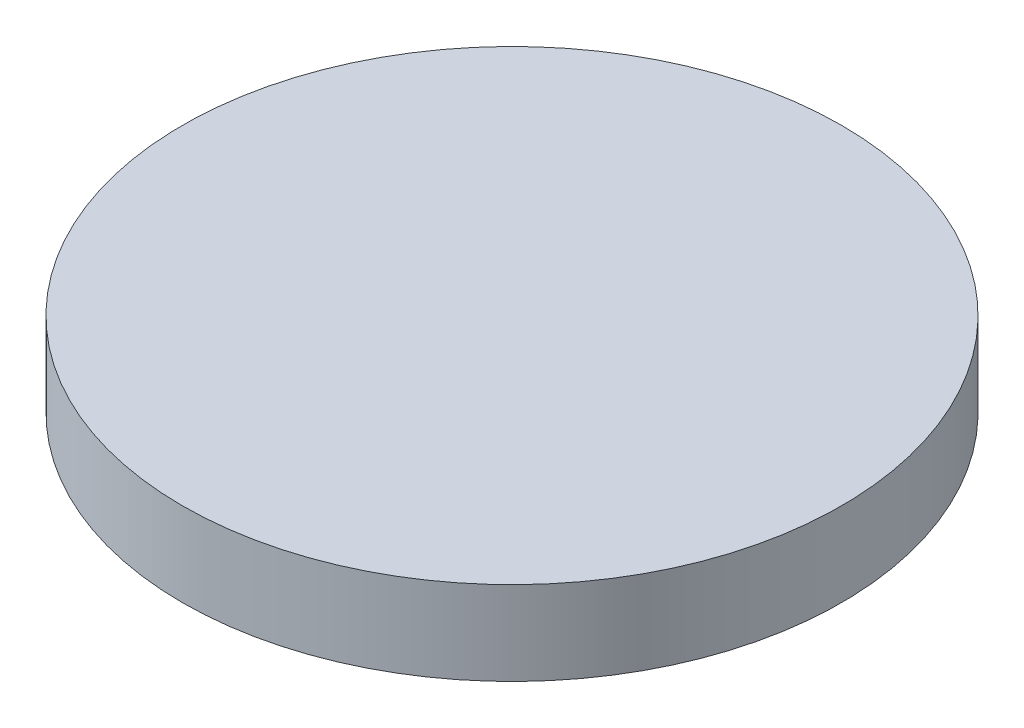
from build123d import *

# Parameters (mm, degrees)
SKETCH_1_R      = 550
EXTRUDE_1_DEPTH = 140


with BuildPart() as part:
    # Sketch 1 → Extrude 1 (new body)
    with BuildSketch(Plane(origin=(0, 0, 0), x_dir=(1, 0, 0), z_dir=(0, 1, 0))):
        with Locations(Location((0, 0, 0), (0, 0, 270))):
            Circle(SKETCH_1_R)
    extrude(amount=EXTRUDE_1_DEPTH)


solid = part.part
